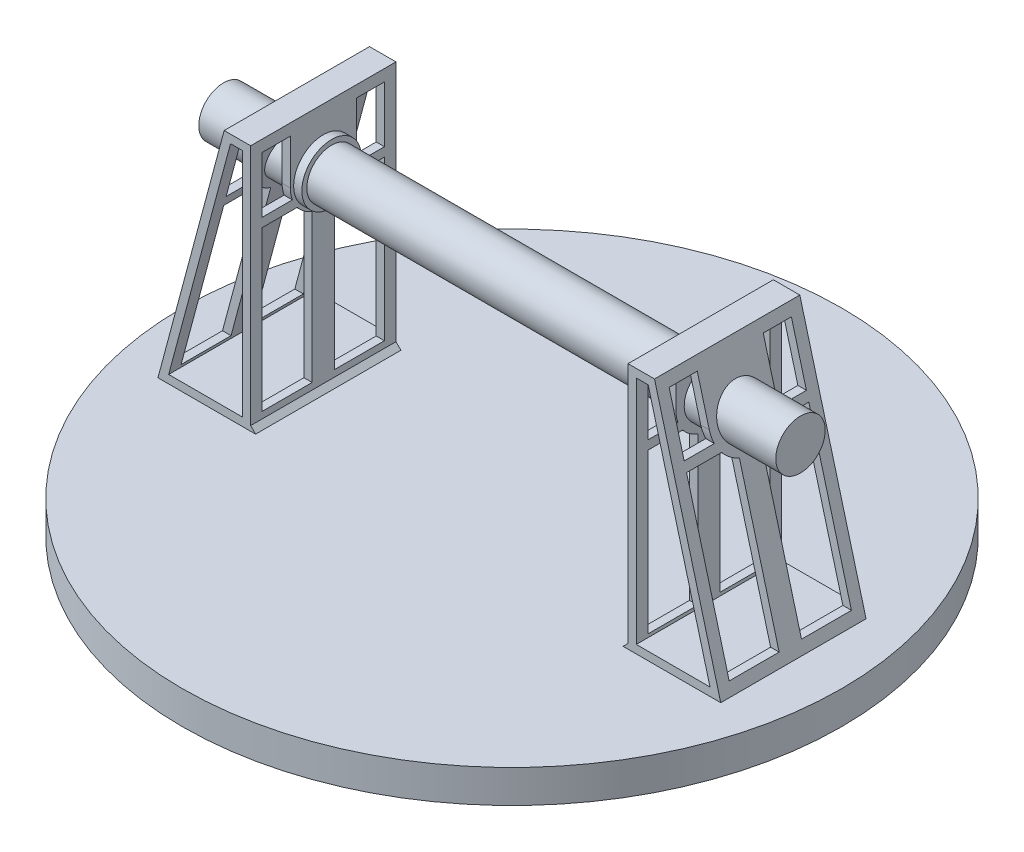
from build123d import *

# Parameters (mm, degrees)
SKETCH1_R           = 5
BOSS_EXTRUDE1_DEPTH = 10
SKETCH2_R           = 10
BOSS_EXTRUDE2_DEPTH = 3
SKETCH3_R           = 200
BOSS_EXTRUDE3_DEPTH = 20
SKETCH4_W           = 56.240354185
SKETCH4_H           = 88.151005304
BOSS_EXTRUDE4_DEPTH = 150
DRAFT1_ANGLE        = 15
CUT_EXTRUDE1_DEPTH  = 365.776439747
SKETCH6_R           = 15
CUT_EXTRUDE2_DEPTH  = 130
SKETCH7_R           = 15
BOSS_EXTRUDE5_DEPTH = 175
SKETCH8_R           = 18
SKETCH8_R_2         = 15
BOSS_EXTRUDE6_DEPTH = 5
CHAMFER1_SIZE       = 3
CHAMFER2_SIZE       = 3


with BuildPart() as part:
    # Sketch1 → Boss-Extrude1 (new body)
    with BuildSketch(Plane(origin=(0, 0, 0), x_dir=(1, 0, 0), z_dir=(0, 1, 0))):
        with Locations(Location((0, 0, 0), (0, 0, 270))):
            Circle(SKETCH1_R)
    extrude(amount=BOSS_EXTRUDE1_DEPTH)

    # Sketch2 → Boss-Extrude2 (add)
    with BuildSketch(Plane(origin=(0, 10, 0), x_dir=(1, 0, 0), z_dir=(0, 1, 0))):
        with Locations(Location((0, 0, 0), (0, 0, 270))):
            Circle(SKETCH2_R)
    extrude(amount=BOSS_EXTRUDE2_DEPTH)

    # Sketch3 → Boss-Extrude3 (add)
    with BuildSketch(Plane(origin=(0, 13, 0), x_dir=(1, 0, 0), z_dir=(0, 1, 0))):
        with Locations(Location((0, 0, 0), (0, 0, 270))):
            Circle(SKETCH3_R)
    extrude(amount=BOSS_EXTRUDE3_DEPTH)

    # Sketch4 → Boss-Extrude4 (add)
    with BuildSketch(Plane(origin=(0, 33, 0), x_dir=(1, 0, 0), z_dir=(0, 1, 0))):
        with Locations((-142.582499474, 0)):
            Rectangle(SKETCH4_W, SKETCH4_H)
    extrude(amount=BOSS_EXTRUDE4_DEPTH)

    # Draft1
    draft1_faces = [part.faces().sort_by_distance(p)[0] for p in [
        (-170.702676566, 108, 0),
    ]]
    draft(draft1_faces, Plane.ZX.offset(33), DRAFT1_ANGLE)

    # Sketch5 → Cut-Extrude1 (cut, through all)
    with BuildSketch(Plane.XY.offset(44.075502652)):
        Polygon((-164.186549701, 38), (-119.462322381, 38), (-119.462322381, 178), (-126.673662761, 178), align=None)
    extrude(amount=-CUT_EXTRUDE1_DEPTH, mode=Mode.SUBTRACT)

    # Sketch6 → Cut-Extrude2 (cut)
    with BuildSketch(Plane(origin=(-114.462322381, 0, 0), x_dir=(0, 0, -1), z_dir=(1, 0, 0))):
        with BuildLine():
            Line((-15.804338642, 136.504965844), (-37.075502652, 136.504965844))
            Line((-37.075502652, 136.504965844), (-37.075502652, 40))
            Line((-37.075502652, 40), (-6.784190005, 40))
            Line((-6.784190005, 40), (-6.784190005, 129.947293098))
            ThreePointArc((-6.784190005, 129.947293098), (-11.760577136, 132.584711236), (-15.804338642, 136.504965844))
        make_face()
        with BuildLine():
            Line((37.075502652, 40), (37.075502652, 136.504965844))
            Line((37.075502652, 136.504965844), (15.804338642, 136.504965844))
            ThreePointArc((15.804338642, 136.504965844), (11.760577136, 132.584711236), (6.784190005, 129.947293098))
            Line((6.784190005, 129.947293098), (6.784190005, 40))
            Line((6.784190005, 40), (37.075502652, 40))
        make_face()
        with Locations((0, 148.761510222)):
            Circle(SKETCH6_R)
        with BuildLine():
            ThreePointArc((-18.795048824, 141.924395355), (-19.696458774, 145.290269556), (-20, 148.761510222))
            Line((-20, 148.761510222), (-20, 176))
            Line((-20, 176), (-37.075502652, 176))
            Line((-37.075502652, 176), (-37.075502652, 141.924395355))
            Line((-37.075502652, 141.924395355), (-18.795048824, 141.924395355))
        make_face()
        with BuildLine():
            Line((37.075502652, 176), (20, 176))
            Line((20, 176), (20, 148.761510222))
            ThreePointArc((20, 148.761510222), (19.696458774, 145.290269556), (18.795048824, 141.924395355))
            Line((18.795048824, 141.924395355), (37.075502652, 141.924395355))
            Line((37.075502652, 141.924395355), (37.075502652, 176))
        make_face()
    extrude(amount=-CUT_EXTRUDE2_DEPTH, mode=Mode.SUBTRACT)

    # Mirror2: part across plane


with BuildPart() as part_1:
    add(part.part)
    add(part.part.mirror(Plane(origin=(0, 0, 0), x_dir=(0, 0, 1), z_dir=(1, 0, 0))))

    # Sketch7 → Boss-Extrude5 (add, symmetric)
    with BuildSketch(Plane(origin=(0, 0, 0), x_dir=(0, 0, -1), z_dir=(1, 0, 0))):
        with Locations(Location((0, 148.761510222, 0), (0, 0, 90))):
            Circle(SKETCH7_R)
    extrude(amount=BOSS_EXTRUDE5_DEPTH, both=True)

    # Sketch8 → Boss-Extrude6 (add)
    with BuildSketch(Plane.ZY.offset(-114.462322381)):
        with Locations(Location((0, 148.761510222, 0), (0, 0, 180))):
            Circle(SKETCH8_R)
        with Locations(Location((0, 148.761510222, 0), (0, 0, 90))):
            Circle(SKETCH8_R_2, mode=Mode.SUBTRACT)
    boss_extrude6 = extrude(amount=BOSS_EXTRUDE6_DEPTH)

    # Mirror3: Boss-Extrude6 across plane
    add(boss_extrude6.mirror(Plane(origin=(0, 0, 0), x_dir=(0, 0, 1), z_dir=(1, 0, 0))))

    # Chamfer1
    chamfer1_edges = [part_1.edges().sort_by_distance(p)[0] for p in [
        (114.462322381, 33, 0),
    ]]
    chamfer(chamfer1_edges, length=CHAMFER1_SIZE)

    # Chamfer2
    chamfer2_edges = [part_1.edges().sort_by_distance(p)[0] for p in [
        (-114.462322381, 33, 0),
    ]]
    chamfer(chamfer2_edges, length=CHAMFER2_SIZE)


solid = part_1.part
